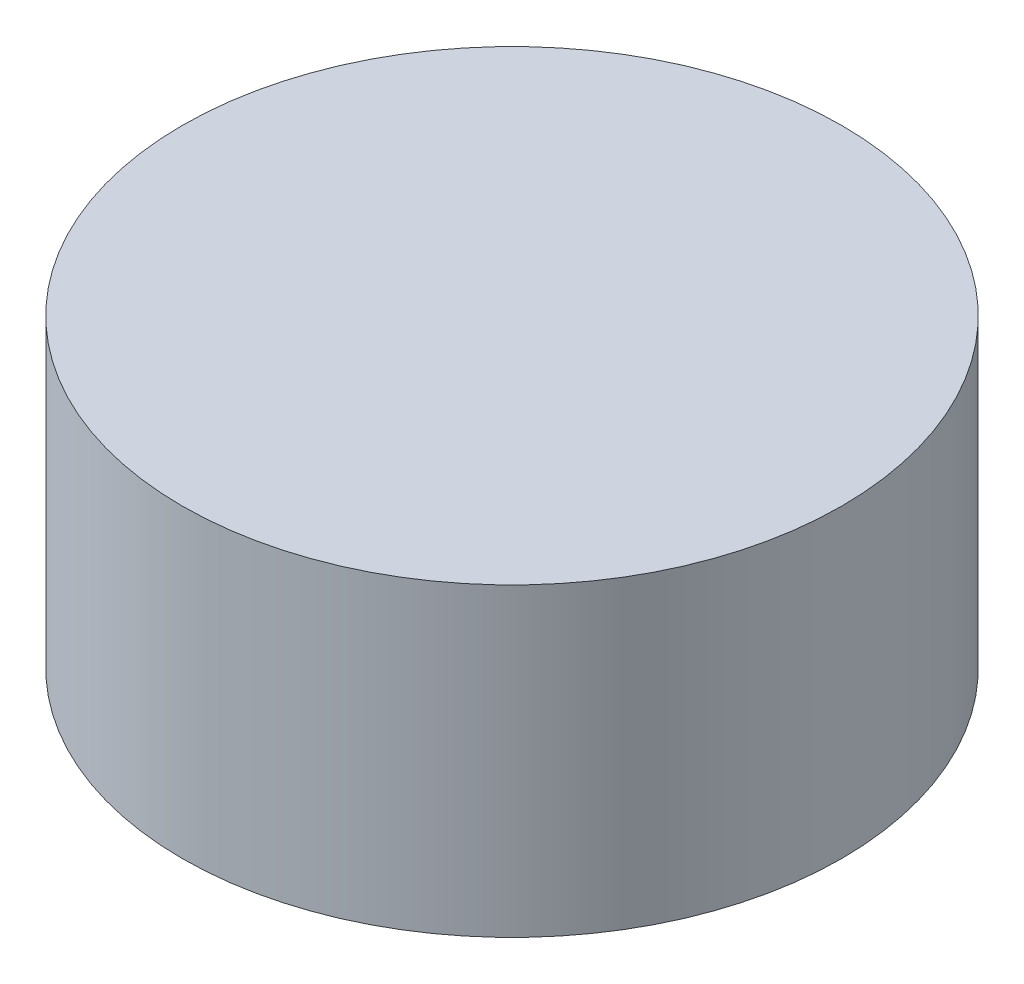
ISO-10303-21;
HEADER;
FILE_DESCRIPTION(('STEP AP214'),'2;1');
FILE_NAME('part.step','',(''),(''),'','','');
FILE_SCHEMA(('AUTOMOTIVE_DESIGN { 1 0 10303 214 1 1 1 1 }'));
ENDSEC;
DATA;
#1=APPLICATION_CONTEXT('core data for automotive mechanical design processes');
#2=APPLICATION_PROTOCOL_DEFINITION('international standard','automotive_design',2000,#1);
#3=PRODUCT_CONTEXT('',#1,'mechanical');
#4=PRODUCT('Part','Part','',(#3));
#5=PRODUCT_RELATED_PRODUCT_CATEGORY('part','',(#4));
#6=PRODUCT_DEFINITION_FORMATION('','',#4);
#7=PRODUCT_DEFINITION_CONTEXT('part definition',#1,'design');
#8=PRODUCT_DEFINITION('design','',#6,#7);
#9=PRODUCT_DEFINITION_SHAPE('','',#8);
#10=(LENGTH_UNIT() NAMED_UNIT(*) SI_UNIT(.MILLI.,.METRE.));
#11=(NAMED_UNIT(*) PLANE_ANGLE_UNIT() SI_UNIT($,.RADIAN.));
#12=(NAMED_UNIT(*) SI_UNIT($,.STERADIAN.) SOLID_ANGLE_UNIT());
#13=UNCERTAINTY_MEASURE_WITH_UNIT(LENGTH_MEASURE(1.E-05),#10,'distance_accuracy_value','');
#14=(GEOMETRIC_REPRESENTATION_CONTEXT(3) GLOBAL_UNCERTAINTY_ASSIGNED_CONTEXT((#13)) GLOBAL_UNIT_ASSIGNED_CONTEXT((#10,
#11,#12)) REPRESENTATION_CONTEXT('',''));
#15=CARTESIAN_POINT('',(0.,0.,0.));
#16=DIRECTION('',(0.,0.,1.));
#17=DIRECTION('',(1.,0.,0.));
#18=AXIS2_PLACEMENT_3D('',#15,#16,#17);
#19=CARTESIAN_POINT('',(0.,1.91,0.));
#20=DIRECTION('',(0.,-1.,0.));
#21=DIRECTION('',(0.,0.,-1.));
#22=AXIS2_PLACEMENT_3D('',#19,#20,#21);
#23=CYLINDRICAL_SURFACE('',#22,0.54);
#24=CARTESIAN_POINT('',(0.,1.91,0.));
#25=DIRECTION('',(0.,1.,0.));
#26=DIRECTION('',(0.,0.,1.));
#27=AXIS2_PLACEMENT_3D('',#24,#25,#26);
#28=CIRCLE('',#27,0.54);
#29=CARTESIAN_POINT('',(0.,1.91,0.54));
#30=VERTEX_POINT('',#29);
#31=EDGE_CURVE('E10',#30,#30,#28,.T.);
#32=ORIENTED_EDGE('',*,*,#31,.F.);
#33=EDGE_LOOP('',(#32));
#34=FACE_BOUND('',#33,.T.);
#35=CARTESIAN_POINT('',(0.,1.41,0.));
#36=DIRECTION('',(0.,1.,0.));
#37=DIRECTION('',(0.,0.,1.));
#38=AXIS2_PLACEMENT_3D('',#35,#36,#37);
#39=CIRCLE('',#38,0.54);
#40=CARTESIAN_POINT('',(0.,1.41,0.54));
#41=VERTEX_POINT('',#40);
#42=EDGE_CURVE('E35',#41,#41,#39,.T.);
#43=ORIENTED_EDGE('',*,*,#42,.T.);
#44=EDGE_LOOP('',(#43));
#45=FACE_BOUND('',#44,.T.);
#46=ADVANCED_FACE('F32',(#34,#45),#23,.T.);
#47=CARTESIAN_POINT('',(0.,1.91,0.));
#48=DIRECTION('',(0.,1.,0.));
#49=DIRECTION('',(0.,0.,1.));
#50=AXIS2_PLACEMENT_3D('',#47,#48,#49);
#51=PLANE('',#50);
#52=ORIENTED_EDGE('',*,*,#31,.T.);
#53=EDGE_LOOP('',(#52));
#54=FACE_BOUND('',#53,.T.);
#55=ADVANCED_FACE('F47',(#54),#51,.T.);
#56=CARTESIAN_POINT('',(0.,1.41,0.));
#57=DIRECTION('',(0.,1.,0.));
#58=DIRECTION('',(0.,0.,1.));
#59=AXIS2_PLACEMENT_3D('',#56,#57,#58);
#60=PLANE('',#59);
#61=ORIENTED_EDGE('',*,*,#42,.F.);
#62=EDGE_LOOP('',(#61));
#63=FACE_BOUND('',#62,.T.);
#64=ADVANCED_FACE('F45',(#63),#60,.F.);
#65=CLOSED_SHELL('',(#46,#55,#64));
#66=MANIFOLD_SOLID_BREP('B2',#65);
#67=ADVANCED_BREP_SHAPE_REPRESENTATION('',(#18,#66),#14);
#68=SHAPE_DEFINITION_REPRESENTATION(#9,#67);
ENDSEC;
END-ISO-10303-21;
